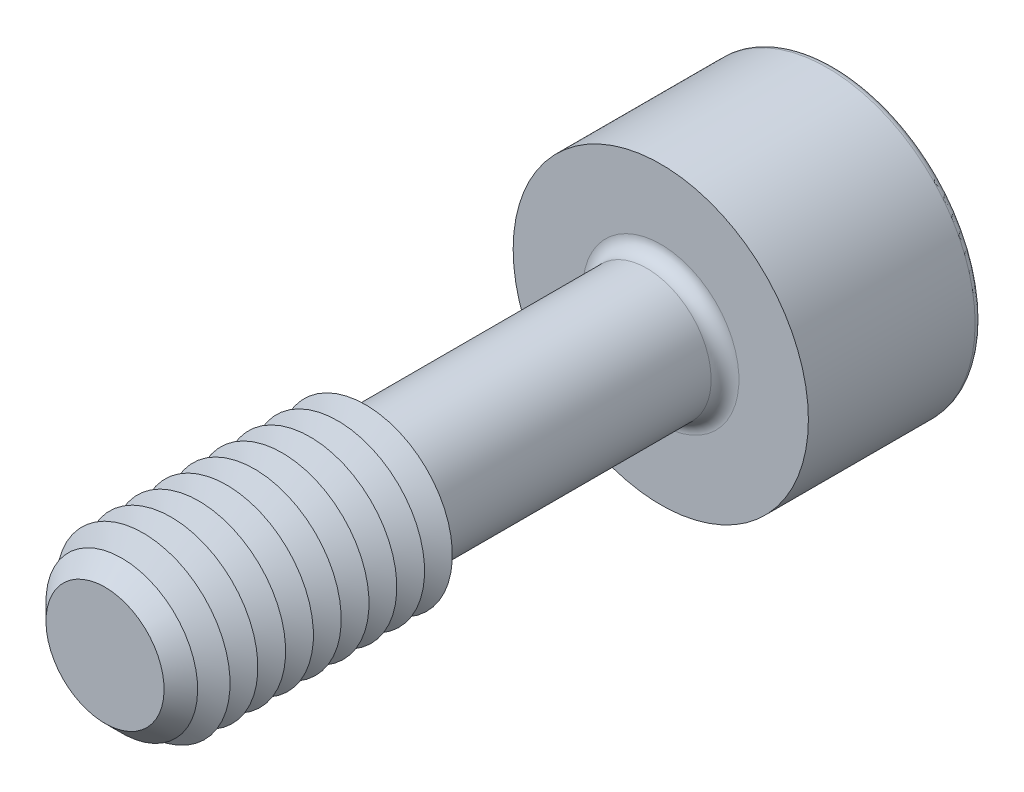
ISO-10303-21;
HEADER;
FILE_DESCRIPTION(('STEP AP214'),'2;1');
FILE_NAME('part.step','',(''),(''),'','','');
FILE_SCHEMA(('AUTOMOTIVE_DESIGN { 1 0 10303 214 1 1 1 1 }'));
ENDSEC;
DATA;
#1=APPLICATION_CONTEXT('core data for automotive mechanical design processes');
#2=APPLICATION_PROTOCOL_DEFINITION('international standard','automotive_design',2000,#1);
#3=PRODUCT_CONTEXT('',#1,'mechanical');
#4=PRODUCT('Part','Part','',(#3));
#5=PRODUCT_RELATED_PRODUCT_CATEGORY('part','',(#4));
#6=PRODUCT_DEFINITION_FORMATION('','',#4);
#7=PRODUCT_DEFINITION_CONTEXT('part definition',#1,'design');
#8=PRODUCT_DEFINITION('design','',#6,#7);
#9=PRODUCT_DEFINITION_SHAPE('','',#8);
#10=(LENGTH_UNIT() NAMED_UNIT(*) SI_UNIT(.MILLI.,.METRE.));
#11=(NAMED_UNIT(*) PLANE_ANGLE_UNIT() SI_UNIT($,.RADIAN.));
#12=(NAMED_UNIT(*) SI_UNIT($,.STERADIAN.) SOLID_ANGLE_UNIT());
#13=UNCERTAINTY_MEASURE_WITH_UNIT(LENGTH_MEASURE(1.E-05),#10,'distance_accuracy_value','');
#14=(GEOMETRIC_REPRESENTATION_CONTEXT(3) GLOBAL_UNCERTAINTY_ASSIGNED_CONTEXT((#13)) GLOBAL_UNIT_ASSIGNED_CONTEXT((#10,
#11,#12)) REPRESENTATION_CONTEXT('',''));
#15=CARTESIAN_POINT('',(0.,0.,0.));
#16=DIRECTION('',(0.,0.,1.));
#17=DIRECTION('',(1.,0.,0.));
#18=AXIS2_PLACEMENT_3D('',#15,#16,#17);
#19=CARTESIAN_POINT('',(-1.15470053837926,-2.,-9.));
#20=DIRECTION('',(0.,0.,1.));
#21=DIRECTION('',(1.,0.,0.));
#22=AXIS2_PLACEMENT_3D('',#19,#20,#21);
#23=PLANE('',#22);
#24=DIRECTION('',(1.,0.,0.));
#25=VECTOR('',#24,1.);
#26=CARTESIAN_POINT('',(-1.15470053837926,-2.,-9.));
#27=LINE('',#26,#25);
#28=CARTESIAN_POINT('',(0.,-2.,-9.));
#29=VERTEX_POINT('',#28);
#30=CARTESIAN_POINT('',(1.15470053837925,-2.,-9.));
#31=VERTEX_POINT('',#30);
#32=EDGE_CURVE('E798',#29,#31,#27,.T.);
#33=ORIENTED_EDGE('',*,*,#32,.F.);
#34=CARTESIAN_POINT('',(0.,0.,-8.99999999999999));
#35=DIRECTION('',(0.,0.,1.));
#36=DIRECTION('',(0.,-1.,0.));
#37=AXIS2_PLACEMENT_3D('',#34,#35,#36);
#38=CIRCLE('',#37,2.);
#39=CARTESIAN_POINT('',(1.73205080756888,-0.999999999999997,-9.));
#40=VERTEX_POINT('',#39);
#41=EDGE_CURVE('E53',#29,#40,#38,.T.);
#42=ORIENTED_EDGE('',*,*,#41,.T.);
#43=DIRECTION('',(0.5,0.866025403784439,0.));
#44=VECTOR('',#43,1.);
#45=CARTESIAN_POINT('',(1.15470053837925,-2.,-9.));
#46=LINE('',#45,#44);
#47=EDGE_CURVE('E783',#31,#40,#46,.T.);
#48=ORIENTED_EDGE('',*,*,#47,.F.);
#49=EDGE_LOOP('',(#33,#42,#48));
#50=FACE_BOUND('',#49,.T.);
#51=ADVANCED_FACE('F41',(#50),#23,.F.);
#52=CARTESIAN_POINT('',(2.3094010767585,0.,-9.));
#53=VERTEX_POINT('',#52);
#54=EDGE_CURVE('E794',#40,#53,#46,.T.);
#55=ORIENTED_EDGE('',*,*,#54,.F.);
#56=CARTESIAN_POINT('',(1.73205080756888,1.,-8.99999999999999));
#57=VERTEX_POINT('',#56);
#58=EDGE_CURVE('E11',#40,#57,#38,.T.);
#59=ORIENTED_EDGE('',*,*,#58,.T.);
#60=DIRECTION('',(-0.499999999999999,0.866025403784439,0.));
#61=VECTOR('',#60,1.);
#62=CARTESIAN_POINT('',(2.3094010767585,0.,-9.));
#63=LINE('',#62,#61);
#64=EDGE_CURVE('E782',#53,#57,#63,.T.);
#65=ORIENTED_EDGE('',*,*,#64,.F.);
#66=EDGE_LOOP('',(#55,#59,#65));
#67=FACE_BOUND('',#66,.T.);
#68=ADVANCED_FACE('F133',(#67),#23,.F.);
#69=CARTESIAN_POINT('',(1.15470053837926,2.,-9.));
#70=VERTEX_POINT('',#69);
#71=EDGE_CURVE('E777',#57,#70,#63,.T.);
#72=ORIENTED_EDGE('',*,*,#71,.F.);
#73=CARTESIAN_POINT('',(0.,2.00000000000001,-8.99999999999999));
#74=VERTEX_POINT('',#73);
#75=EDGE_CURVE('E51',#57,#74,#38,.T.);
#76=ORIENTED_EDGE('',*,*,#75,.T.);
#77=DIRECTION('',(-1.,0.,0.));
#78=VECTOR('',#77,1.);
#79=CARTESIAN_POINT('',(1.15470053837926,2.,-9.));
#80=LINE('',#79,#78);
#81=EDGE_CURVE('E177',#70,#74,#80,.T.);
#82=ORIENTED_EDGE('',*,*,#81,.F.);
#83=EDGE_LOOP('',(#72,#76,#82));
#84=FACE_BOUND('',#83,.T.);
#85=ADVANCED_FACE('F139',(#84),#23,.F.);
#86=CARTESIAN_POINT('',(-1.15470053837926,2.,-9.));
#87=VERTEX_POINT('',#86);
#88=EDGE_CURVE('E788',#74,#87,#80,.T.);
#89=ORIENTED_EDGE('',*,*,#88,.F.);
#90=CARTESIAN_POINT('',(-1.73205080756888,1.00000000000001,-8.99999999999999));
#91=VERTEX_POINT('',#90);
#92=EDGE_CURVE('E266',#74,#91,#38,.T.);
#93=ORIENTED_EDGE('',*,*,#92,.T.);
#94=DIRECTION('',(-0.5,-0.866025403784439,0.));
#95=VECTOR('',#94,1.);
#96=CARTESIAN_POINT('',(-1.15470053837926,2.,-9.));
#97=LINE('',#96,#95);
#98=EDGE_CURVE('E176',#87,#91,#97,.T.);
#99=ORIENTED_EDGE('',*,*,#98,.F.);
#100=EDGE_LOOP('',(#89,#93,#99));
#101=FACE_BOUND('',#100,.T.);
#102=ADVANCED_FACE('F157',(#101),#23,.F.);
#103=CARTESIAN_POINT('',(-2.30940107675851,0.,-9.));
#104=VERTEX_POINT('',#103);
#105=EDGE_CURVE('E170',#91,#104,#97,.T.);
#106=ORIENTED_EDGE('',*,*,#105,.F.);
#107=CARTESIAN_POINT('',(-1.73205080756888,-0.999999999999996,-9.));
#108=VERTEX_POINT('',#107);
#109=EDGE_CURVE('E172',#91,#108,#38,.T.);
#110=ORIENTED_EDGE('',*,*,#109,.T.);
#111=DIRECTION('',(0.5,-0.866025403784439,0.));
#112=VECTOR('',#111,1.);
#113=CARTESIAN_POINT('',(-2.30940107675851,0.,-9.));
#114=LINE('',#113,#112);
#115=EDGE_CURVE('E174',#104,#108,#114,.T.);
#116=ORIENTED_EDGE('',*,*,#115,.F.);
#117=EDGE_LOOP('',(#106,#110,#116));
#118=FACE_BOUND('',#117,.T.);
#119=ADVANCED_FACE('F146',(#118),#23,.F.);
#120=CARTESIAN_POINT('',(0.,0.,-13.));
#121=DIRECTION('',(0.,0.,-1.));
#122=DIRECTION('',(-1.,0.,0.));
#123=AXIS2_PLACEMENT_3D('',#120,#121,#122);
#124=PLANE('',#123);
#125=CARTESIAN_POINT('',(0.,0.,-13.));
#126=DIRECTION('',(0.,0.,-1.));
#127=DIRECTION('',(-1.,0.,0.));
#128=AXIS2_PLACEMENT_3D('',#125,#126,#127);
#129=CIRCLE('',#128,4.05);
#130=CARTESIAN_POINT('',(-4.05,0.,-13.));
#131=VERTEX_POINT('',#130);
#132=EDGE_CURVE('E251',#131,#131,#129,.T.);
#133=ORIENTED_EDGE('',*,*,#132,.T.);
#134=EDGE_LOOP('',(#133));
#135=FACE_BOUND('',#134,.T.);
#136=DIRECTION('',(-0.5,-0.866025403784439,0.));
#137=VECTOR('',#136,1.);
#138=CARTESIAN_POINT('',(-1.15470053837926,2.,-13.));
#139=LINE('',#138,#137);
#140=CARTESIAN_POINT('',(-1.15470053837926,2.,-13.));
#141=VERTEX_POINT('',#140);
#142=CARTESIAN_POINT('',(-2.30940107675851,0.,-13.));
#143=VERTEX_POINT('',#142);
#144=EDGE_CURVE('E212',#141,#143,#139,.T.);
#145=ORIENTED_EDGE('',*,*,#144,.T.);
#146=DIRECTION('',(0.5,-0.866025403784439,0.));
#147=VECTOR('',#146,1.);
#148=CARTESIAN_POINT('',(-2.30940107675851,0.,-13.));
#149=LINE('',#148,#147);
#150=CARTESIAN_POINT('',(-1.15470053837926,-2.,-13.));
#151=VERTEX_POINT('',#150);
#152=EDGE_CURVE('E67',#143,#151,#149,.T.);
#153=ORIENTED_EDGE('',*,*,#152,.T.);
#154=DIRECTION('',(1.,0.,0.));
#155=VECTOR('',#154,1.);
#156=CARTESIAN_POINT('',(-1.15470053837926,-2.,-13.));
#157=LINE('',#156,#155);
#158=CARTESIAN_POINT('',(1.15470053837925,-2.,-13.));
#159=VERTEX_POINT('',#158);
#160=EDGE_CURVE('E196',#151,#159,#157,.T.);
#161=ORIENTED_EDGE('',*,*,#160,.T.);
#162=DIRECTION('',(0.5,0.866025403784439,0.));
#163=VECTOR('',#162,1.);
#164=CARTESIAN_POINT('',(1.15470053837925,-2.,-13.));
#165=LINE('',#164,#163);
#166=CARTESIAN_POINT('',(2.3094010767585,0.,-13.));
#167=VERTEX_POINT('',#166);
#168=EDGE_CURVE('E200',#159,#167,#165,.T.);
#169=ORIENTED_EDGE('',*,*,#168,.T.);
#170=DIRECTION('',(-0.499999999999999,0.866025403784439,0.));
#171=VECTOR('',#170,1.);
#172=CARTESIAN_POINT('',(2.3094010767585,0.,-13.));
#173=LINE('',#172,#171);
#174=CARTESIAN_POINT('',(1.15470053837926,2.,-13.));
#175=VERTEX_POINT('',#174);
#176=EDGE_CURVE('E204',#167,#175,#173,.T.);
#177=ORIENTED_EDGE('',*,*,#176,.T.);
#178=DIRECTION('',(-1.,0.,0.));
#179=VECTOR('',#178,1.);
#180=CARTESIAN_POINT('',(1.15470053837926,2.,-13.));
#181=LINE('',#180,#179);
#182=EDGE_CURVE('E208',#175,#141,#181,.T.);
#183=ORIENTED_EDGE('',*,*,#182,.T.);
#184=EDGE_LOOP('',(#145,#153,#161,#169,#177,#183));
#185=FACE_BOUND('',#184,.T.);
#186=ADVANCED_FACE('F156',(#135,#185),#124,.T.);
#187=CARTESIAN_POINT('',(0.,0.,8.));
#188=DIRECTION('',(0.,0.,-1.));
#189=DIRECTION('',(-1.,0.,0.));
#190=AXIS2_PLACEMENT_3D('',#187,#188,#189);
#191=CYLINDRICAL_SURFACE('',#190,1.85);
#192=CARTESIAN_POINT('',(0.,0.,-7.6));
#193=DIRECTION('',(0.,0.,-1.));
#194=DIRECTION('',(-1.,0.,0.));
#195=AXIS2_PLACEMENT_3D('',#192,#193,#194);
#196=CIRCLE('',#195,1.85);
#197=CARTESIAN_POINT('',(-1.85,0.,-7.6));
#198=VERTEX_POINT('',#197);
#199=EDGE_CURVE('E247',#198,#198,#196,.F.);
#200=ORIENTED_EDGE('',*,*,#199,.T.);
#201=EDGE_LOOP('',(#200));
#202=FACE_BOUND('',#201,.T.);
#203=CARTESIAN_POINT('',(0.,0.,0.124722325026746));
#204=DIRECTION('',(0.,0.,-1.));
#205=DIRECTION('',(0.,1.,0.));
#206=AXIS2_PLACEMENT_3D('',#203,#204,#205);
#207=CIRCLE('',#206,1.85);
#208=CARTESIAN_POINT('',(0.,1.85,0.124722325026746));
#209=VERTEX_POINT('',#208);
#210=EDGE_CURVE('E235',#209,#209,#207,.T.);
#211=ORIENTED_EDGE('',*,*,#210,.T.);
#212=EDGE_LOOP('',(#211));
#213=FACE_BOUND('',#212,.T.);
#214=ADVANCED_FACE('F163',(#202,#213),#191,.T.);
#215=CARTESIAN_POINT('',(0.,0.,0.124722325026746));
#216=DIRECTION('',(0.,0.,1.));
#217=DIRECTION('',(0.,-1.,0.));
#218=AXIS2_PLACEMENT_3D('',#215,#216,#217);
#219=CONICAL_SURFACE('',#218,1.85,1.0471975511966);
#220=CARTESIAN_POINT('',(0.,0.,0.5));
#221=DIRECTION('',(0.,0.,-1.));
#222=DIRECTION('',(-1.,0.,0.));
#223=AXIS2_PLACEMENT_3D('',#220,#221,#222);
#224=CIRCLE('',#223,2.5);
#225=CARTESIAN_POINT('',(-2.5,0.,0.5));
#226=VERTEX_POINT('',#225);
#227=EDGE_CURVE('E270',#226,#226,#224,.T.);
#228=ORIENTED_EDGE('',*,*,#227,.T.);
#229=EDGE_LOOP('',(#228));
#230=FACE_BOUND('',#229,.T.);
#231=ORIENTED_EDGE('',*,*,#210,.F.);
#232=EDGE_LOOP('',(#231));
#233=FACE_BOUND('',#232,.T.);
#234=ADVANCED_FACE('F538',(#230,#233),#219,.T.);
#235=CARTESIAN_POINT('',(0.,0.,-8.));
#236=DIRECTION('',(0.,0.,-1.));
#237=DIRECTION('',(-1.,0.,0.));
#238=AXIS2_PLACEMENT_3D('',#235,#236,#237);
#239=PLANE('',#238);
#240=CARTESIAN_POINT('',(0.,0.,-8.));
#241=DIRECTION('',(0.,0.,-1.));
#242=DIRECTION('',(-1.,0.,0.));
#243=AXIS2_PLACEMENT_3D('',#240,#241,#242);
#244=CIRCLE('',#243,2.25);
#245=CARTESIAN_POINT('',(-2.25,0.,-8.));
#246=VERTEX_POINT('',#245);
#247=EDGE_CURVE('E243',#246,#246,#244,.T.);
#248=ORIENTED_EDGE('',*,*,#247,.T.);
#249=EDGE_LOOP('',(#248));
#250=FACE_BOUND('',#249,.T.);
#251=CARTESIAN_POINT('',(0.,0.,-8.));
#252=DIRECTION('',(0.,0.,-1.));
#253=DIRECTION('',(-1.,0.,0.));
#254=AXIS2_PLACEMENT_3D('',#251,#252,#253);
#255=CIRCLE('',#254,4.25);
#256=CARTESIAN_POINT('',(-4.25,0.,-8.));
#257=VERTEX_POINT('',#256);
#258=EDGE_CURVE('E231',#257,#257,#255,.T.);
#259=ORIENTED_EDGE('',*,*,#258,.F.);
#260=EDGE_LOOP('',(#259));
#261=FACE_BOUND('',#260,.T.);
#262=ADVANCED_FACE('F531',(#250,#261),#239,.F.);
#263=CARTESIAN_POINT('',(0.,0.,-13.));
#264=DIRECTION('',(0.,0.,1.));
#265=DIRECTION('',(1.,0.,0.));
#266=AXIS2_PLACEMENT_3D('',#263,#264,#265);
#267=CYLINDRICAL_SURFACE('',#266,4.25);
#268=CARTESIAN_POINT('',(0.,0.,-12.8));
#269=DIRECTION('',(0.,0.,-1.));
#270=DIRECTION('',(-1.,0.,0.));
#271=AXIS2_PLACEMENT_3D('',#268,#269,#270);
#272=CIRCLE('',#271,4.25);
#273=CARTESIAN_POINT('',(-4.25,0.,-12.8));
#274=VERTEX_POINT('',#273);
#275=EDGE_CURVE('E254',#274,#274,#272,.F.);
#276=ORIENTED_EDGE('',*,*,#275,.T.);
#277=EDGE_LOOP('',(#276));
#278=FACE_BOUND('',#277,.T.);
#279=ORIENTED_EDGE('',*,*,#258,.T.);
#280=EDGE_LOOP('',(#279));
#281=FACE_BOUND('',#280,.T.);
#282=ADVANCED_FACE('F537',(#278,#281),#267,.T.);
#283=CARTESIAN_POINT('',(-2.30940107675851,0.,-9.));
#284=DIRECTION('',(0.866025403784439,0.5,0.));
#285=DIRECTION('',(-0.5,0.866025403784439,0.));
#286=AXIS2_PLACEMENT_3D('',#283,#284,#285);
#287=PLANE('',#286);
#288=ORIENTED_EDGE('',*,*,#152,.F.);
#289=DIRECTION('',(0.,0.,-1.));
#290=VECTOR('',#289,1.);
#291=CARTESIAN_POINT('',(-2.30940107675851,0.,-9.));
#292=LINE('',#291,#290);
#293=EDGE_CURVE('E186',#104,#143,#292,.T.);
#294=ORIENTED_EDGE('',*,*,#293,.F.);
#295=ORIENTED_EDGE('',*,*,#115,.T.);
#296=CARTESIAN_POINT('',(-1.15470053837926,-2.,-9.));
#297=VERTEX_POINT('',#296);
#298=EDGE_CURVE('E215',#108,#297,#114,.T.);
#299=ORIENTED_EDGE('',*,*,#298,.T.);
#300=DIRECTION('',(0.,0.,-1.));
#301=VECTOR('',#300,1.);
#302=CARTESIAN_POINT('',(-1.15470053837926,-2.,-9.));
#303=LINE('',#302,#301);
#304=EDGE_CURVE('E228',#297,#151,#303,.T.);
#305=ORIENTED_EDGE('',*,*,#304,.T.);
#306=EDGE_LOOP('',(#288,#294,#295,#299,#305));
#307=FACE_BOUND('',#306,.T.);
#308=ADVANCED_FACE('F549',(#307),#287,.T.);
#309=CARTESIAN_POINT('',(-1.15470053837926,-2.,-9.));
#310=DIRECTION('',(0.,1.,0.));
#311=DIRECTION('',(-1.,0.,0.));
#312=AXIS2_PLACEMENT_3D('',#309,#310,#311);
#313=PLANE('',#312);
#314=ORIENTED_EDGE('',*,*,#160,.F.);
#315=ORIENTED_EDGE('',*,*,#304,.F.);
#316=EDGE_CURVE('E795',#297,#29,#27,.T.);
#317=ORIENTED_EDGE('',*,*,#316,.T.);
#318=ORIENTED_EDGE('',*,*,#32,.T.);
#319=DIRECTION('',(0.,0.,-1.));
#320=VECTOR('',#319,1.);
#321=CARTESIAN_POINT('',(1.15470053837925,-2.,-9.));
#322=LINE('',#321,#320);
#323=EDGE_CURVE('E225',#31,#159,#322,.T.);
#324=ORIENTED_EDGE('',*,*,#323,.T.);
#325=EDGE_LOOP('',(#314,#315,#317,#318,#324));
#326=FACE_BOUND('',#325,.T.);
#327=ADVANCED_FACE('F565',(#326),#313,.T.);
#328=CARTESIAN_POINT('',(1.15470053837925,-2.,-9.));
#329=DIRECTION('',(-0.866025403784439,0.5,0.));
#330=DIRECTION('',(-0.5,-0.866025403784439,0.));
#331=AXIS2_PLACEMENT_3D('',#328,#329,#330);
#332=PLANE('',#331);
#333=ORIENTED_EDGE('',*,*,#168,.F.);
#334=ORIENTED_EDGE('',*,*,#323,.F.);
#335=ORIENTED_EDGE('',*,*,#47,.T.);
#336=ORIENTED_EDGE('',*,*,#54,.T.);
#337=DIRECTION('',(0.,0.,-1.));
#338=VECTOR('',#337,1.);
#339=CARTESIAN_POINT('',(2.3094010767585,0.,-9.));
#340=LINE('',#339,#338);
#341=EDGE_CURVE('E222',#53,#167,#340,.T.);
#342=ORIENTED_EDGE('',*,*,#341,.T.);
#343=EDGE_LOOP('',(#333,#334,#335,#336,#342));
#344=FACE_BOUND('',#343,.T.);
#345=ADVANCED_FACE('F575',(#344),#332,.T.);
#346=CARTESIAN_POINT('',(2.3094010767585,0.,-9.));
#347=DIRECTION('',(-0.866025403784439,-0.499999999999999,0.));
#348=DIRECTION('',(0.499999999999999,-0.866025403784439,0.));
#349=AXIS2_PLACEMENT_3D('',#346,#347,#348);
#350=PLANE('',#349);
#351=ORIENTED_EDGE('',*,*,#176,.F.);
#352=ORIENTED_EDGE('',*,*,#341,.F.);
#353=ORIENTED_EDGE('',*,*,#64,.T.);
#354=ORIENTED_EDGE('',*,*,#71,.T.);
#355=DIRECTION('',(0.,0.,-1.));
#356=VECTOR('',#355,1.);
#357=CARTESIAN_POINT('',(1.15470053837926,2.,-9.));
#358=LINE('',#357,#356);
#359=EDGE_CURVE('E219',#70,#175,#358,.T.);
#360=ORIENTED_EDGE('',*,*,#359,.T.);
#361=EDGE_LOOP('',(#351,#352,#353,#354,#360));
#362=FACE_BOUND('',#361,.T.);
#363=ADVANCED_FACE('F585',(#362),#350,.T.);
#364=CARTESIAN_POINT('',(1.15470053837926,2.,-9.));
#365=DIRECTION('',(0.,-1.,0.));
#366=DIRECTION('',(0.,0.,-1.));
#367=AXIS2_PLACEMENT_3D('',#364,#365,#366);
#368=PLANE('',#367);
#369=ORIENTED_EDGE('',*,*,#182,.F.);
#370=ORIENTED_EDGE('',*,*,#359,.F.);
#371=ORIENTED_EDGE('',*,*,#81,.T.);
#372=ORIENTED_EDGE('',*,*,#88,.T.);
#373=DIRECTION('',(0.,0.,-1.));
#374=VECTOR('',#373,1.);
#375=CARTESIAN_POINT('',(-1.15470053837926,2.,-9.));
#376=LINE('',#375,#374);
#377=EDGE_CURVE('E182',#87,#141,#376,.T.);
#378=ORIENTED_EDGE('',*,*,#377,.T.);
#379=EDGE_LOOP('',(#369,#370,#371,#372,#378));
#380=FACE_BOUND('',#379,.T.);
#381=ADVANCED_FACE('F152',(#380),#368,.T.);
#382=CARTESIAN_POINT('',(-1.15470053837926,2.,-9.));
#383=DIRECTION('',(0.866025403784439,-0.5,0.));
#384=DIRECTION('',(0.5,0.866025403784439,0.));
#385=AXIS2_PLACEMENT_3D('',#382,#383,#384);
#386=PLANE('',#385);
#387=ORIENTED_EDGE('',*,*,#144,.F.);
#388=ORIENTED_EDGE('',*,*,#377,.F.);
#389=ORIENTED_EDGE('',*,*,#98,.T.);
#390=ORIENTED_EDGE('',*,*,#105,.T.);
#391=ORIENTED_EDGE('',*,*,#293,.T.);
#392=EDGE_LOOP('',(#387,#388,#389,#390,#391));
#393=FACE_BOUND('',#392,.T.);
#394=ADVANCED_FACE('F144',(#393),#386,.T.);
#395=ORIENTED_EDGE('',*,*,#298,.F.);
#396=EDGE_CURVE('E257',#108,#29,#38,.T.);
#397=ORIENTED_EDGE('',*,*,#396,.T.);
#398=ORIENTED_EDGE('',*,*,#316,.F.);
#399=EDGE_LOOP('',(#395,#397,#398));
#400=FACE_BOUND('',#399,.T.);
#401=ADVANCED_FACE('F135',(#400),#23,.F.);
#402=CARTESIAN_POINT('',(0.,0.,-7.6));
#403=DIRECTION('',(0.,0.,-1.));
#404=DIRECTION('',(-1.,0.,0.));
#405=AXIS2_PLACEMENT_3D('',#402,#403,#404);
#406=TOROIDAL_SURFACE('',#405,2.25,0.4);
#407=ORIENTED_EDGE('',*,*,#199,.F.);
#408=EDGE_LOOP('',(#407));
#409=FACE_BOUND('',#408,.T.);
#410=ORIENTED_EDGE('',*,*,#247,.F.);
#411=EDGE_LOOP('',(#410));
#412=FACE_BOUND('',#411,.T.);
#413=ADVANCED_FACE('F129',(#409,#412),#406,.F.);
#414=CARTESIAN_POINT('',(0.,0.,-12.8));
#415=DIRECTION('',(0.,0.,-1.));
#416=DIRECTION('',(-1.,0.,0.));
#417=AXIS2_PLACEMENT_3D('',#414,#415,#416);
#418=TOROIDAL_SURFACE('',#417,4.05,0.2);
#419=ORIENTED_EDGE('',*,*,#275,.F.);
#420=EDGE_LOOP('',(#419));
#421=FACE_BOUND('',#420,.T.);
#422=ORIENTED_EDGE('',*,*,#132,.F.);
#423=EDGE_LOOP('',(#422));
#424=FACE_BOUND('',#423,.T.);
#425=ADVANCED_FACE('F43',(#421,#424),#418,.T.);
#426=CARTESIAN_POINT('',(0.,0.,-7.84529946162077));
#427=DIRECTION('',(0.,0.,-1.));
#428=DIRECTION('',(0.,1.,0.));
#429=AXIS2_PLACEMENT_3D('',#426,#427,#428);
#430=CONICAL_SURFACE('',#429,0.,1.04719755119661);
#431=ORIENTED_EDGE('',*,*,#41,.F.);
#432=ORIENTED_EDGE('',*,*,#396,.F.);
#433=ORIENTED_EDGE('',*,*,#109,.F.);
#434=ORIENTED_EDGE('',*,*,#92,.F.);
#435=ORIENTED_EDGE('',*,*,#75,.F.);
#436=ORIENTED_EDGE('',*,*,#58,.F.);
#437=EDGE_LOOP('',(#431,#432,#433,#434,#435,#436));
#438=FACE_BOUND('',#437,.T.);
#439=CARTESIAN_POINT('',(0.,0.,-7.84529946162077));
#440=VERTEX_POINT('',#439);
#441=VERTEX_LOOP('',#440);
#442=FACE_BOUND('',#441,.T.);
#443=ADVANCED_FACE('F118',(#438,#442),#430,.F.);
#444=CARTESIAN_POINT('',(0.,0.,0.900000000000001));
#445=DIRECTION('',(0.,0.,-1.));
#446=DIRECTION('',(-1.,0.,0.));
#447=AXIS2_PLACEMENT_3D('',#444,#445,#446);
#448=CONICAL_SURFACE('',#447,1.80717967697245,1.0471975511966);
#449=ORIENTED_EDGE('',*,*,#227,.F.);
#450=EDGE_LOOP('',(#449));
#451=FACE_BOUND('',#450,.T.);
#452=CARTESIAN_POINT('',(0.,0.,0.900000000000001));
#453=DIRECTION('',(0.,0.,-1.));
#454=DIRECTION('',(-1.,0.,0.));
#455=AXIS2_PLACEMENT_3D('',#452,#453,#454);
#456=CIRCLE('',#455,1.80717967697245);
#457=CARTESIAN_POINT('',(-1.80717967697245,0.,0.900000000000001));
#458=VERTEX_POINT('',#457);
#459=EDGE_CURVE('E276',#458,#458,#456,.T.);
#460=ORIENTED_EDGE('',*,*,#459,.T.);
#461=EDGE_LOOP('',(#460));
#462=FACE_BOUND('',#461,.T.);
#463=ADVANCED_FACE('F120',(#451,#462),#448,.T.);
#464=CARTESIAN_POINT('',(0.,0.,1.3));
#465=DIRECTION('',(0.,0.,1.));
#466=DIRECTION('',(1.,0.,0.));
#467=AXIS2_PLACEMENT_3D('',#464,#465,#466);
#468=CONICAL_SURFACE('',#467,2.5,1.0471975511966);
#469=ORIENTED_EDGE('',*,*,#459,.F.);
#470=EDGE_LOOP('',(#469));
#471=FACE_BOUND('',#470,.T.);
#472=CARTESIAN_POINT('',(0.,0.,1.3));
#473=DIRECTION('',(0.,0.,-1.));
#474=DIRECTION('',(-1.,0.,0.));
#475=AXIS2_PLACEMENT_3D('',#472,#473,#474);
#476=CIRCLE('',#475,2.5);
#477=CARTESIAN_POINT('',(-2.5,0.,1.3));
#478=VERTEX_POINT('',#477);
#479=EDGE_CURVE('E281',#478,#478,#476,.T.);
#480=ORIENTED_EDGE('',*,*,#479,.T.);
#481=EDGE_LOOP('',(#480));
#482=FACE_BOUND('',#481,.T.);
#483=ADVANCED_FACE('F126',(#471,#482),#468,.T.);
#484=CARTESIAN_POINT('',(0.,0.,1.7));
#485=DIRECTION('',(0.,0.,-1.));
#486=DIRECTION('',(-1.,0.,0.));
#487=AXIS2_PLACEMENT_3D('',#484,#485,#486);
#488=CONICAL_SURFACE('',#487,1.80717967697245,1.0471975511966);
#489=ORIENTED_EDGE('',*,*,#479,.F.);
#490=EDGE_LOOP('',(#489));
#491=FACE_BOUND('',#490,.T.);
#492=CARTESIAN_POINT('',(0.,0.,1.7));
#493=DIRECTION('',(0.,0.,-1.));
#494=DIRECTION('',(-1.,0.,0.));
#495=AXIS2_PLACEMENT_3D('',#492,#493,#494);
#496=CIRCLE('',#495,1.80717967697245);
#497=CARTESIAN_POINT('',(-1.80717967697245,0.,1.7));
#498=VERTEX_POINT('',#497);
#499=EDGE_CURVE('E287',#498,#498,#496,.T.);
#500=ORIENTED_EDGE('',*,*,#499,.T.);
#501=EDGE_LOOP('',(#500));
#502=FACE_BOUND('',#501,.T.);
#503=ADVANCED_FACE('F415',(#491,#502),#488,.T.);
#504=CARTESIAN_POINT('',(0.,0.,2.1));
#505=DIRECTION('',(0.,0.,1.));
#506=DIRECTION('',(1.,0.,0.));
#507=AXIS2_PLACEMENT_3D('',#504,#505,#506);
#508=CONICAL_SURFACE('',#507,2.5,1.0471975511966);
#509=ORIENTED_EDGE('',*,*,#499,.F.);
#510=EDGE_LOOP('',(#509));
#511=FACE_BOUND('',#510,.T.);
#512=CARTESIAN_POINT('',(0.,0.,2.1));
#513=DIRECTION('',(0.,0.,-1.));
#514=DIRECTION('',(-1.,0.,0.));
#515=AXIS2_PLACEMENT_3D('',#512,#513,#514);
#516=CIRCLE('',#515,2.5);
#517=CARTESIAN_POINT('',(-2.5,0.,2.1));
#518=VERTEX_POINT('',#517);
#519=EDGE_CURVE('E291',#518,#518,#516,.T.);
#520=ORIENTED_EDGE('',*,*,#519,.T.);
#521=EDGE_LOOP('',(#520));
#522=FACE_BOUND('',#521,.T.);
#523=ADVANCED_FACE('F411',(#511,#522),#508,.T.);
#524=CARTESIAN_POINT('',(0.,0.,2.5));
#525=DIRECTION('',(0.,0.,-1.));
#526=DIRECTION('',(-1.,0.,0.));
#527=AXIS2_PLACEMENT_3D('',#524,#525,#526);
#528=CONICAL_SURFACE('',#527,1.80717967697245,1.0471975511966);
#529=ORIENTED_EDGE('',*,*,#519,.F.);
#530=EDGE_LOOP('',(#529));
#531=FACE_BOUND('',#530,.T.);
#532=CARTESIAN_POINT('',(0.,0.,2.5));
#533=DIRECTION('',(0.,0.,-1.));
#534=DIRECTION('',(-1.,0.,0.));
#535=AXIS2_PLACEMENT_3D('',#532,#533,#534);
#536=CIRCLE('',#535,1.80717967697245);
#537=CARTESIAN_POINT('',(-1.80717967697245,0.,2.5));
#538=VERTEX_POINT('',#537);
#539=EDGE_CURVE('E295',#538,#538,#536,.T.);
#540=ORIENTED_EDGE('',*,*,#539,.T.);
#541=EDGE_LOOP('',(#540));
#542=FACE_BOUND('',#541,.T.);
#543=ADVANCED_FACE('F407',(#531,#542),#528,.T.);
#544=CARTESIAN_POINT('',(0.,0.,2.9));
#545=DIRECTION('',(0.,0.,1.));
#546=DIRECTION('',(1.,0.,0.));
#547=AXIS2_PLACEMENT_3D('',#544,#545,#546);
#548=CONICAL_SURFACE('',#547,2.5,1.0471975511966);
#549=ORIENTED_EDGE('',*,*,#539,.F.);
#550=EDGE_LOOP('',(#549));
#551=FACE_BOUND('',#550,.T.);
#552=CARTESIAN_POINT('',(0.,0.,2.9));
#553=DIRECTION('',(0.,0.,-1.));
#554=DIRECTION('',(-1.,0.,0.));
#555=AXIS2_PLACEMENT_3D('',#552,#553,#554);
#556=CIRCLE('',#555,2.5);
#557=CARTESIAN_POINT('',(-2.5,0.,2.9));
#558=VERTEX_POINT('',#557);
#559=EDGE_CURVE('E298',#558,#558,#556,.T.);
#560=ORIENTED_EDGE('',*,*,#559,.T.);
#561=EDGE_LOOP('',(#560));
#562=FACE_BOUND('',#561,.T.);
#563=ADVANCED_FACE('F403',(#551,#562),#548,.T.);
#564=CARTESIAN_POINT('',(0.,0.,3.3));
#565=DIRECTION('',(0.,0.,-1.));
#566=DIRECTION('',(-1.,0.,0.));
#567=AXIS2_PLACEMENT_3D('',#564,#565,#566);
#568=CONICAL_SURFACE('',#567,1.80717967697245,1.0471975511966);
#569=ORIENTED_EDGE('',*,*,#559,.F.);
#570=EDGE_LOOP('',(#569));
#571=FACE_BOUND('',#570,.T.);
#572=CARTESIAN_POINT('',(0.,0.,3.3));
#573=DIRECTION('',(0.,0.,-1.));
#574=DIRECTION('',(-1.,0.,0.));
#575=AXIS2_PLACEMENT_3D('',#572,#573,#574);
#576=CIRCLE('',#575,1.80717967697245);
#577=CARTESIAN_POINT('',(-1.80717967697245,0.,3.3));
#578=VERTEX_POINT('',#577);
#579=EDGE_CURVE('E301',#578,#578,#576,.T.);
#580=ORIENTED_EDGE('',*,*,#579,.T.);
#581=EDGE_LOOP('',(#580));
#582=FACE_BOUND('',#581,.T.);
#583=ADVANCED_FACE('F399',(#571,#582),#568,.T.);
#584=CARTESIAN_POINT('',(0.,0.,3.7));
#585=DIRECTION('',(0.,0.,1.));
#586=DIRECTION('',(1.,0.,0.));
#587=AXIS2_PLACEMENT_3D('',#584,#585,#586);
#588=CONICAL_SURFACE('',#587,2.5,1.0471975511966);
#589=ORIENTED_EDGE('',*,*,#579,.F.);
#590=EDGE_LOOP('',(#589));
#591=FACE_BOUND('',#590,.T.);
#592=CARTESIAN_POINT('',(0.,0.,3.7));
#593=DIRECTION('',(0.,0.,-1.));
#594=DIRECTION('',(-1.,0.,0.));
#595=AXIS2_PLACEMENT_3D('',#592,#593,#594);
#596=CIRCLE('',#595,2.5);
#597=CARTESIAN_POINT('',(-2.5,0.,3.7));
#598=VERTEX_POINT('',#597);
#599=EDGE_CURVE('E305',#598,#598,#596,.T.);
#600=ORIENTED_EDGE('',*,*,#599,.T.);
#601=EDGE_LOOP('',(#600));
#602=FACE_BOUND('',#601,.T.);
#603=ADVANCED_FACE('F395',(#591,#602),#588,.T.);
#604=CARTESIAN_POINT('',(0.,0.,4.1));
#605=DIRECTION('',(0.,0.,-1.));
#606=DIRECTION('',(-1.,0.,0.));
#607=AXIS2_PLACEMENT_3D('',#604,#605,#606);
#608=CONICAL_SURFACE('',#607,1.80717967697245,1.0471975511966);
#609=ORIENTED_EDGE('',*,*,#599,.F.);
#610=EDGE_LOOP('',(#609));
#611=FACE_BOUND('',#610,.T.);
#612=CARTESIAN_POINT('',(0.,0.,4.1));
#613=DIRECTION('',(0.,0.,-1.));
#614=DIRECTION('',(-1.,0.,0.));
#615=AXIS2_PLACEMENT_3D('',#612,#613,#614);
#616=CIRCLE('',#615,1.80717967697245);
#617=CARTESIAN_POINT('',(-1.80717967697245,0.,4.1));
#618=VERTEX_POINT('',#617);
#619=EDGE_CURVE('E309',#618,#618,#616,.T.);
#620=ORIENTED_EDGE('',*,*,#619,.T.);
#621=EDGE_LOOP('',(#620));
#622=FACE_BOUND('',#621,.T.);
#623=ADVANCED_FACE('F391',(#611,#622),#608,.T.);
#624=CARTESIAN_POINT('',(0.,0.,4.5));
#625=DIRECTION('',(0.,0.,1.));
#626=DIRECTION('',(1.,0.,0.));
#627=AXIS2_PLACEMENT_3D('',#624,#625,#626);
#628=CONICAL_SURFACE('',#627,2.5,1.0471975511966);
#629=ORIENTED_EDGE('',*,*,#619,.F.);
#630=EDGE_LOOP('',(#629));
#631=FACE_BOUND('',#630,.T.);
#632=CARTESIAN_POINT('',(0.,0.,4.5));
#633=DIRECTION('',(0.,0.,-1.));
#634=DIRECTION('',(-1.,0.,0.));
#635=AXIS2_PLACEMENT_3D('',#632,#633,#634);
#636=CIRCLE('',#635,2.5);
#637=CARTESIAN_POINT('',(-2.5,0.,4.5));
#638=VERTEX_POINT('',#637);
#639=EDGE_CURVE('E313',#638,#638,#636,.T.);
#640=ORIENTED_EDGE('',*,*,#639,.T.);
#641=EDGE_LOOP('',(#640));
#642=FACE_BOUND('',#641,.T.);
#643=ADVANCED_FACE('F387',(#631,#642),#628,.T.);
#644=CARTESIAN_POINT('',(0.,0.,4.9));
#645=DIRECTION('',(0.,0.,-1.));
#646=DIRECTION('',(-1.,0.,0.));
#647=AXIS2_PLACEMENT_3D('',#644,#645,#646);
#648=CONICAL_SURFACE('',#647,1.80717967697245,1.0471975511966);
#649=ORIENTED_EDGE('',*,*,#639,.F.);
#650=EDGE_LOOP('',(#649));
#651=FACE_BOUND('',#650,.T.);
#652=CARTESIAN_POINT('',(0.,0.,4.9));
#653=DIRECTION('',(0.,0.,-1.));
#654=DIRECTION('',(-1.,0.,0.));
#655=AXIS2_PLACEMENT_3D('',#652,#653,#654);
#656=CIRCLE('',#655,1.80717967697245);
#657=CARTESIAN_POINT('',(-1.80717967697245,0.,4.9));
#658=VERTEX_POINT('',#657);
#659=EDGE_CURVE('E317',#658,#658,#656,.T.);
#660=ORIENTED_EDGE('',*,*,#659,.T.);
#661=EDGE_LOOP('',(#660));
#662=FACE_BOUND('',#661,.T.);
#663=ADVANCED_FACE('F383',(#651,#662),#648,.T.);
#664=CARTESIAN_POINT('',(0.,0.,5.3));
#665=DIRECTION('',(0.,0.,1.));
#666=DIRECTION('',(1.,0.,0.));
#667=AXIS2_PLACEMENT_3D('',#664,#665,#666);
#668=CONICAL_SURFACE('',#667,2.5,1.0471975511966);
#669=ORIENTED_EDGE('',*,*,#659,.F.);
#670=EDGE_LOOP('',(#669));
#671=FACE_BOUND('',#670,.T.);
#672=CARTESIAN_POINT('',(0.,0.,5.3));
#673=DIRECTION('',(0.,0.,-1.));
#674=DIRECTION('',(-1.,0.,0.));
#675=AXIS2_PLACEMENT_3D('',#672,#673,#674);
#676=CIRCLE('',#675,2.5);
#677=CARTESIAN_POINT('',(-2.5,0.,5.3));
#678=VERTEX_POINT('',#677);
#679=EDGE_CURVE('E321',#678,#678,#676,.T.);
#680=ORIENTED_EDGE('',*,*,#679,.T.);
#681=EDGE_LOOP('',(#680));
#682=FACE_BOUND('',#681,.T.);
#683=ADVANCED_FACE('F379',(#671,#682),#668,.T.);
#684=CARTESIAN_POINT('',(0.,0.,5.7));
#685=DIRECTION('',(0.,0.,-1.));
#686=DIRECTION('',(-1.,0.,0.));
#687=AXIS2_PLACEMENT_3D('',#684,#685,#686);
#688=CONICAL_SURFACE('',#687,1.80717967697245,1.0471975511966);
#689=ORIENTED_EDGE('',*,*,#679,.F.);
#690=EDGE_LOOP('',(#689));
#691=FACE_BOUND('',#690,.T.);
#692=CARTESIAN_POINT('',(0.,0.,5.7));
#693=DIRECTION('',(0.,0.,-1.));
#694=DIRECTION('',(-1.,0.,0.));
#695=AXIS2_PLACEMENT_3D('',#692,#693,#694);
#696=CIRCLE('',#695,1.80717967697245);
#697=CARTESIAN_POINT('',(-1.80717967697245,0.,5.7));
#698=VERTEX_POINT('',#697);
#699=EDGE_CURVE('E325',#698,#698,#696,.T.);
#700=ORIENTED_EDGE('',*,*,#699,.T.);
#701=EDGE_LOOP('',(#700));
#702=FACE_BOUND('',#701,.T.);
#703=ADVANCED_FACE('F375',(#691,#702),#688,.T.);
#704=CARTESIAN_POINT('',(0.,0.,6.1));
#705=DIRECTION('',(0.,0.,1.));
#706=DIRECTION('',(1.,0.,0.));
#707=AXIS2_PLACEMENT_3D('',#704,#705,#706);
#708=CONICAL_SURFACE('',#707,2.5,1.0471975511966);
#709=ORIENTED_EDGE('',*,*,#699,.F.);
#710=EDGE_LOOP('',(#709));
#711=FACE_BOUND('',#710,.T.);
#712=CARTESIAN_POINT('',(0.,0.,6.1));
#713=DIRECTION('',(0.,0.,-1.));
#714=DIRECTION('',(-1.,0.,0.));
#715=AXIS2_PLACEMENT_3D('',#712,#713,#714);
#716=CIRCLE('',#715,2.5);
#717=CARTESIAN_POINT('',(-2.5,0.,6.1));
#718=VERTEX_POINT('',#717);
#719=EDGE_CURVE('E329',#718,#718,#716,.T.);
#720=ORIENTED_EDGE('',*,*,#719,.T.);
#721=EDGE_LOOP('',(#720));
#722=FACE_BOUND('',#721,.T.);
#723=ADVANCED_FACE('F371',(#711,#722),#708,.T.);
#724=CARTESIAN_POINT('',(0.,0.,6.5));
#725=DIRECTION('',(0.,0.,-1.));
#726=DIRECTION('',(-1.,0.,0.));
#727=AXIS2_PLACEMENT_3D('',#724,#725,#726);
#728=CONICAL_SURFACE('',#727,1.80717967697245,1.0471975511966);
#729=ORIENTED_EDGE('',*,*,#719,.F.);
#730=EDGE_LOOP('',(#729));
#731=FACE_BOUND('',#730,.T.);
#732=CARTESIAN_POINT('',(0.,0.,6.5));
#733=DIRECTION('',(0.,0.,-1.));
#734=DIRECTION('',(-1.,0.,0.));
#735=AXIS2_PLACEMENT_3D('',#732,#733,#734);
#736=CIRCLE('',#735,1.80717967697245);
#737=CARTESIAN_POINT('',(-1.80717967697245,0.,6.5));
#738=VERTEX_POINT('',#737);
#739=EDGE_CURVE('E332',#738,#738,#736,.T.);
#740=ORIENTED_EDGE('',*,*,#739,.T.);
#741=EDGE_LOOP('',(#740));
#742=FACE_BOUND('',#741,.T.);
#743=ADVANCED_FACE('F367',(#731,#742),#728,.T.);
#744=CARTESIAN_POINT('',(0.,0.,6.9));
#745=DIRECTION('',(0.,0.,1.));
#746=DIRECTION('',(1.,0.,0.));
#747=AXIS2_PLACEMENT_3D('',#744,#745,#746);
#748=CONICAL_SURFACE('',#747,2.5,1.0471975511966);
#749=ORIENTED_EDGE('',*,*,#739,.F.);
#750=EDGE_LOOP('',(#749));
#751=FACE_BOUND('',#750,.T.);
#752=CARTESIAN_POINT('',(0.,0.,6.9));
#753=DIRECTION('',(0.,0.,-1.));
#754=DIRECTION('',(-1.,0.,0.));
#755=AXIS2_PLACEMENT_3D('',#752,#753,#754);
#756=CIRCLE('',#755,2.5);
#757=CARTESIAN_POINT('',(-2.5,0.,6.9));
#758=VERTEX_POINT('',#757);
#759=EDGE_CURVE('E336',#758,#758,#756,.T.);
#760=ORIENTED_EDGE('',*,*,#759,.T.);
#761=EDGE_LOOP('',(#760));
#762=FACE_BOUND('',#761,.T.);
#763=ADVANCED_FACE('F360',(#751,#762),#748,.T.);
#764=CARTESIAN_POINT('',(0.,0.,7.3));
#765=DIRECTION('',(0.,0.,-1.));
#766=DIRECTION('',(-1.,0.,0.));
#767=AXIS2_PLACEMENT_3D('',#764,#765,#766);
#768=CONICAL_SURFACE('',#767,1.80717967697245,1.0471975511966);
#769=ORIENTED_EDGE('',*,*,#759,.F.);
#770=EDGE_LOOP('',(#769));
#771=FACE_BOUND('',#770,.T.);
#772=CARTESIAN_POINT('',(0.,0.,7.3));
#773=DIRECTION('',(0.,0.,-1.));
#774=DIRECTION('',(-1.,0.,0.));
#775=AXIS2_PLACEMENT_3D('',#772,#773,#774);
#776=CIRCLE('',#775,1.80717967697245);
#777=CARTESIAN_POINT('',(-1.80717967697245,0.,7.3));
#778=VERTEX_POINT('',#777);
#779=EDGE_CURVE('E340',#778,#778,#776,.T.);
#780=ORIENTED_EDGE('',*,*,#779,.T.);
#781=EDGE_LOOP('',(#780));
#782=FACE_BOUND('',#781,.T.);
#783=ADVANCED_FACE('F346',(#771,#782),#768,.T.);
#784=CARTESIAN_POINT('',(0.,0.,7.7));
#785=DIRECTION('',(0.,0.,1.));
#786=DIRECTION('',(1.,0.,0.));
#787=AXIS2_PLACEMENT_3D('',#784,#785,#786);
#788=CONICAL_SURFACE('',#787,2.5,1.0471975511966);
#789=CARTESIAN_POINT('',(0.,0.,7.51698729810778));
#790=DIRECTION('',(0.,0.,1.));
#791=DIRECTION('',(1.,0.,0.));
#792=AXIS2_PLACEMENT_3D('',#789,#790,#791);
#793=CIRCLE('',#792,2.18301270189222);
#794=CARTESIAN_POINT('',(0.,2.18301270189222,7.51698729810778));
#795=VERTEX_POINT('',#794);
#796=EDGE_CURVE('E45',#795,#795,#793,.F.);
#797=ORIENTED_EDGE('',*,*,#796,.T.);
#798=EDGE_LOOP('',(#797));
#799=FACE_BOUND('',#798,.T.);
#800=ORIENTED_EDGE('',*,*,#779,.F.);
#801=EDGE_LOOP('',(#800));
#802=FACE_BOUND('',#801,.T.);
#803=ADVANCED_FACE('F348',(#799,#802),#788,.T.);
#804=CARTESIAN_POINT('',(0.,0.,8.));
#805=DIRECTION('',(0.,0.,1.));
#806=DIRECTION('',(1.,0.,0.));
#807=AXIS2_PLACEMENT_3D('',#804,#805,#806);
#808=PLANE('',#807);
#809=CARTESIAN_POINT('',(0.,0.,8.));
#810=DIRECTION('',(0.,0.,1.));
#811=DIRECTION('',(1.,0.,0.));
#812=AXIS2_PLACEMENT_3D('',#809,#810,#811);
#813=CIRCLE('',#812,1.7);
#814=CARTESIAN_POINT('',(0.,1.7,8.));
#815=VERTEX_POINT('',#814);
#816=EDGE_CURVE('E239',#815,#815,#813,.T.);
#817=ORIENTED_EDGE('',*,*,#816,.T.);
#818=EDGE_LOOP('',(#817));
#819=FACE_BOUND('',#818,.T.);
#820=ADVANCED_FACE('F350',(#819),#808,.T.);
#821=CARTESIAN_POINT('',(0.,0.,7.2));
#822=DIRECTION('',(0.,0.,-1.));
#823=DIRECTION('',(0.,1.,0.));
#824=AXIS2_PLACEMENT_3D('',#821,#822,#823);
#825=CONICAL_SURFACE('',#824,2.5,0.78539816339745);
#826=CARTESIAN_POINT('',(0.,2.18301270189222,7.51698729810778));
#827=CARTESIAN_POINT('',(0.,2.17798131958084,7.52201868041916));
#828=CARTESIAN_POINT('',(0.,2.17294993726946,7.52705006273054));
#829=CARTESIAN_POINT('',(0.,2.16288717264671,7.53711282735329));
#830=CARTESIAN_POINT('',(0.,2.15785579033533,7.54214420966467));
#831=CARTESIAN_POINT('',(0.,2.14779302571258,7.55220697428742));
#832=CARTESIAN_POINT('',(0.,2.1427616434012,7.5572383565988));
#833=CARTESIAN_POINT('',(0.,2.13269887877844,7.56730112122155));
#834=CARTESIAN_POINT('',(0.,2.12766749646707,7.57233250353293));
#835=CARTESIAN_POINT('',(0.,2.11760473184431,7.58239526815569));
#836=CARTESIAN_POINT('',(0.,2.11257334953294,7.58742665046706));
#837=CARTESIAN_POINT('',(0.,2.10251058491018,7.59748941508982));
#838=CARTESIAN_POINT('',(0.,2.0974792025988,7.6025207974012));
#839=CARTESIAN_POINT('',(0.,2.08741643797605,7.61258356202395));
#840=CARTESIAN_POINT('',(0.,2.08238505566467,7.61761494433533));
#841=CARTESIAN_POINT('',(0.,2.07232229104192,7.62767770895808));
#842=CARTESIAN_POINT('',(0.,2.06729090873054,7.63270909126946));
#843=CARTESIAN_POINT('',(0.,2.05722814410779,7.64277185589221));
#844=CARTESIAN_POINT('',(0.,2.05219676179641,7.64780323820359));
#845=CARTESIAN_POINT('',(0.,2.04213399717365,7.65786600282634));
#846=CARTESIAN_POINT('',(0.,2.03710261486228,7.66289738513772));
#847=CARTESIAN_POINT('',(0.,2.02703985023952,7.67296014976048));
#848=CARTESIAN_POINT('',(0.,2.02200846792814,7.67799153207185));
#849=CARTESIAN_POINT('',(0.,2.01194570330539,7.68805429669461));
#850=CARTESIAN_POINT('',(0.,2.00691432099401,7.69308567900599));
#851=CARTESIAN_POINT('',(0.,1.99685155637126,7.70314844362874));
#852=CARTESIAN_POINT('',(0.,1.99182017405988,7.70817982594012));
#853=CARTESIAN_POINT('',(0.,1.98175740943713,7.71824259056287));
#854=CARTESIAN_POINT('',(0.,1.97672602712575,7.72327397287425));
#855=CARTESIAN_POINT('',(0.,1.96666326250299,7.733336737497));
#856=CARTESIAN_POINT('',(0.,1.96163188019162,7.73836811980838));
#857=CARTESIAN_POINT('',(0.,1.95156911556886,7.74843088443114));
#858=CARTESIAN_POINT('',(0.,1.94653773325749,7.75346226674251));
#859=CARTESIAN_POINT('',(0.,1.93647496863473,7.76352503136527));
#860=CARTESIAN_POINT('',(0.,1.93144358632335,7.76855641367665));
#861=CARTESIAN_POINT('',(0.,1.9213808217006,7.7786191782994));
#862=CARTESIAN_POINT('',(0.,1.91634943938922,7.78365056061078));
#863=CARTESIAN_POINT('',(0.,1.90628667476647,7.79371332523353));
#864=CARTESIAN_POINT('',(0.,1.90125529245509,7.79874470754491));
#865=CARTESIAN_POINT('',(0.,1.89119252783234,7.80880747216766));
#866=CARTESIAN_POINT('',(0.,1.88616114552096,7.81383885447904));
#867=CARTESIAN_POINT('',(0.,1.8760983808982,7.82390161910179));
#868=CARTESIAN_POINT('',(0.,1.87106699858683,7.82893300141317));
#869=CARTESIAN_POINT('',(0.,1.86100423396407,7.83899576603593));
#870=CARTESIAN_POINT('',(0.,1.85597285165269,7.8440271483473));
#871=CARTESIAN_POINT('',(0.,1.84591008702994,7.85408991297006));
#872=CARTESIAN_POINT('',(0.,1.84087870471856,7.85912129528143));
#873=CARTESIAN_POINT('',(0.,1.83081594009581,7.86918405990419));
#874=CARTESIAN_POINT('',(0.,1.82578455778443,7.87421544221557));
#875=CARTESIAN_POINT('',(0.,1.81572179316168,7.88427820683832));
#876=CARTESIAN_POINT('',(0.,1.8106904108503,7.8893095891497));
#877=CARTESIAN_POINT('',(0.,1.80062764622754,7.89937235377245));
#878=CARTESIAN_POINT('',(0.,1.79559626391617,7.90440373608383));
#879=CARTESIAN_POINT('',(0.,1.78553349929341,7.91446650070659));
#880=CARTESIAN_POINT('',(0.,1.78050211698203,7.91949788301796));
#881=CARTESIAN_POINT('',(0.,1.77043935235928,7.92956064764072));
#882=CARTESIAN_POINT('',(0.,1.7654079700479,7.93459202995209));
#883=CARTESIAN_POINT('',(0.,1.75534520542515,7.94465479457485));
#884=CARTESIAN_POINT('',(0.,1.75031382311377,7.94968617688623));
#885=CARTESIAN_POINT('',(0.,1.74025105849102,7.95974894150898));
#886=CARTESIAN_POINT('',(0.,1.73521967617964,7.96478032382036));
#887=CARTESIAN_POINT('',(0.,1.72515691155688,7.97484308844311));
#888=CARTESIAN_POINT('',(0.,1.72012552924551,7.97987447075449));
#889=CARTESIAN_POINT('',(0.,1.71006276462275,7.98993723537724));
#890=CARTESIAN_POINT('',(0.,1.70503138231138,7.99496861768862));
#891=CARTESIAN_POINT('',(0.,1.7,8.));
#892=B_SPLINE_CURVE_WITH_KNOTS('',3,(#826,#827,#828,#829,#830,#831,#832,#833,#834,#835,#836,
#837,#838,#839,#840,#841,#842,#843,#844,#845,#846,#847,#848,#849,#850,#851,#852,#853,#854,#855,
#856,#857,#858,#859,#860,#861,#862,#863,#864,#865,#866,#867,#868,#869,#870,#871,#872,#873,#874,
#875,#876,#877,#878,#879,#880,#881,#882,#883,#884,#885,#886,#887,#888,#889,#890,#891),
.UNSPECIFIED.,.F.,.F.,(4,2,2,2,2,2,2,2,2,2,2,2,2,2,2,2,2,2,2,2,2,2,2,2,2,2,2,2,2,2,2,2,4),(0.,
0.0213463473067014,0.0426926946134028,0.0640390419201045,0.0853853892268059,0.106731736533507,
0.128078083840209,0.14942443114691,0.170770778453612,0.192117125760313,0.213463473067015,
0.234809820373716,0.256156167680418,0.27750251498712,0.298848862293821,0.320195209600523,
0.341541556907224,0.362887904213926,0.384234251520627,0.405580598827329,0.42692694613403,
0.448273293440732,0.469619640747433,0.490965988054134,0.512312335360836,0.533658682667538,
0.555005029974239,0.57635137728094,0.597697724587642,0.619044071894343,0.640390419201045,
0.661736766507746,0.683083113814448),.UNSPECIFIED.);
#893=EDGE_CURVE('BSEAM357',#795,#815,#892,.T.);
#894=ORIENTED_EDGE('',*,*,#796,.F.);
#895=ORIENTED_EDGE('',*,*,#816,.F.);
#896=ORIENTED_EDGE('',*,*,#893,.T.);
#897=ORIENTED_EDGE('',*,*,#893,.F.);
#898=EDGE_LOOP('',(#894,#896,#895,#897));
#899=FACE_BOUND('',#898,.T.);
#900=ADVANCED_FACE('F357',(#899),#825,.T.);
#901=CLOSED_SHELL('',(#51,#68,#85,#102,#119,#186,#214,#234,#262,#282,#308,#327,#345,#363,#381,
#394,#401,#413,#425,#443,#463,#483,#503,#523,#543,#563,#583,#603,#623,#643,#663,#683,#703,#723,
#743,#763,#783,#803,#820,#900));
#902=MANIFOLD_SOLID_BREP('B2',#901);
#903=ADVANCED_BREP_SHAPE_REPRESENTATION('',(#18,#902),#14);
#904=SHAPE_DEFINITION_REPRESENTATION(#9,#903);
ENDSEC;
END-ISO-10303-21;
